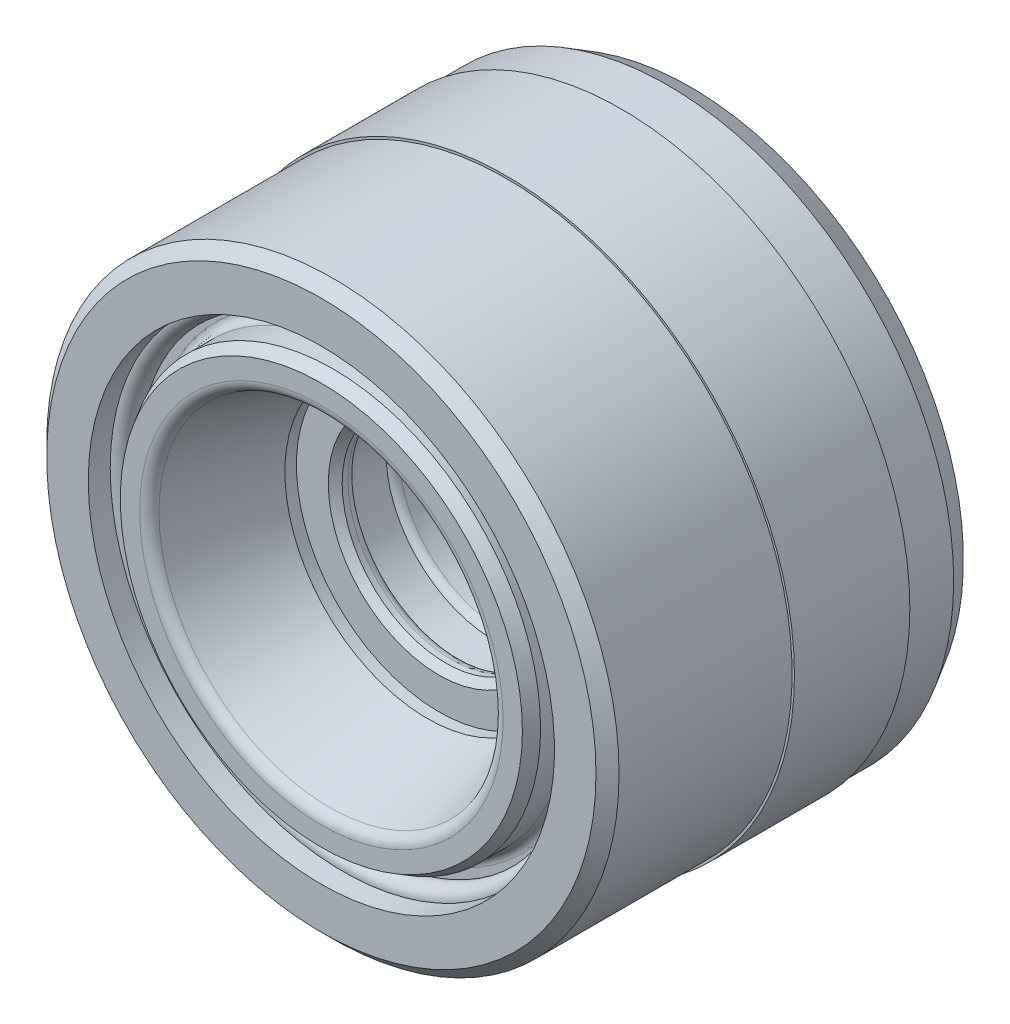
ISO-10303-21;
HEADER;
FILE_DESCRIPTION(('STEP AP214'),'2;1');
FILE_NAME('part.step','',(''),(''),'','','');
FILE_SCHEMA(('AUTOMOTIVE_DESIGN { 1 0 10303 214 1 1 1 1 }'));
ENDSEC;
DATA;
#1=APPLICATION_CONTEXT('core data for automotive mechanical design processes');
#2=APPLICATION_PROTOCOL_DEFINITION('international standard','automotive_design',2000,#1);
#3=PRODUCT_CONTEXT('',#1,'mechanical');
#4=PRODUCT('Part','Part','',(#3));
#5=PRODUCT_RELATED_PRODUCT_CATEGORY('part','',(#4));
#6=PRODUCT_DEFINITION_FORMATION('','',#4);
#7=PRODUCT_DEFINITION_CONTEXT('part definition',#1,'design');
#8=PRODUCT_DEFINITION('design','',#6,#7);
#9=PRODUCT_DEFINITION_SHAPE('','',#8);
#10=(LENGTH_UNIT() NAMED_UNIT(*) SI_UNIT(.MILLI.,.METRE.));
#11=(NAMED_UNIT(*) PLANE_ANGLE_UNIT() SI_UNIT($,.RADIAN.));
#12=(NAMED_UNIT(*) SI_UNIT($,.STERADIAN.) SOLID_ANGLE_UNIT());
#13=UNCERTAINTY_MEASURE_WITH_UNIT(LENGTH_MEASURE(1.E-05),#10,'distance_accuracy_value','');
#14=(GEOMETRIC_REPRESENTATION_CONTEXT(3) GLOBAL_UNCERTAINTY_ASSIGNED_CONTEXT((#13)) GLOBAL_UNIT_ASSIGNED_CONTEXT((#10,
#11,#12)) REPRESENTATION_CONTEXT('',''));
#15=CARTESIAN_POINT('',(0.,0.,0.));
#16=DIRECTION('',(0.,0.,1.));
#17=DIRECTION('',(1.,0.,0.));
#18=AXIS2_PLACEMENT_3D('',#15,#16,#17);
#19=CARTESIAN_POINT('',(6.18097122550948,0.,-5.1));
#20=DIRECTION('',(0.,0.,1.));
#21=DIRECTION('',(1.,0.,0.));
#22=AXIS2_PLACEMENT_3D('',#19,#20,#21);
#23=PLANE('',#22);
#24=CARTESIAN_POINT('',(0.,0.,-5.1));
#25=DIRECTION('',(0.,0.,1.));
#26=DIRECTION('',(1.,0.,0.));
#27=AXIS2_PLACEMENT_3D('',#24,#25,#26);
#28=CIRCLE('',#27,4.8);
#29=CARTESIAN_POINT('',(4.8,0.,-5.1));
#30=VERTEX_POINT('',#29);
#31=EDGE_CURVE('E67',#30,#30,#28,.F.);
#32=ORIENTED_EDGE('',*,*,#31,.T.);
#33=EDGE_LOOP('',(#32));
#34=FACE_BOUND('',#33,.T.);
#35=CARTESIAN_POINT('',(0.,0.,-5.1));
#36=DIRECTION('',(0.,0.,1.));
#37=DIRECTION('',(1.,0.,0.));
#38=AXIS2_PLACEMENT_3D('',#35,#36,#37);
#39=CIRCLE('',#38,6.18097122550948);
#40=CARTESIAN_POINT('',(6.18097122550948,0.,-5.1));
#41=VERTEX_POINT('',#40);
#42=EDGE_CURVE('E58',#41,#41,#39,.T.);
#43=ORIENTED_EDGE('',*,*,#42,.T.);
#44=EDGE_LOOP('',(#43));
#45=FACE_BOUND('',#44,.T.);
#46=ADVANCED_FACE('F12',(#34,#45),#23,.T.);
#47=CARTESIAN_POINT('',(0.,0.,-5.4));
#48=DIRECTION('',(0.,0.,1.));
#49=DIRECTION('',(1.,0.,0.));
#50=AXIS2_PLACEMENT_3D('',#47,#48,#49);
#51=CONICAL_SURFACE('',#50,4.5,0.785398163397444);
#52=ORIENTED_EDGE('',*,*,#31,.F.);
#53=EDGE_LOOP('',(#52));
#54=FACE_BOUND('',#53,.T.);
#55=CARTESIAN_POINT('',(0.,0.,-5.4));
#56=DIRECTION('',(0.,0.,1.));
#57=DIRECTION('',(1.,0.,0.));
#58=AXIS2_PLACEMENT_3D('',#55,#56,#57);
#59=CIRCLE('',#58,4.5);
#60=CARTESIAN_POINT('',(4.5,0.,-5.4));
#61=VERTEX_POINT('',#60);
#62=EDGE_CURVE('E64',#61,#61,#59,.T.);
#63=ORIENTED_EDGE('',*,*,#62,.F.);
#64=EDGE_LOOP('',(#63));
#65=FACE_BOUND('',#64,.T.);
#66=ADVANCED_FACE('F166',(#54,#65),#51,.F.);
#67=CARTESIAN_POINT('',(0.,0.,-5.1));
#68=DIRECTION('',(0.,0.,1.));
#69=DIRECTION('',(1.,0.,0.));
#70=AXIS2_PLACEMENT_3D('',#67,#68,#69);
#71=CYLINDRICAL_SURFACE('',#70,4.5);
#72=CARTESIAN_POINT('',(0.,0.,-5.65358983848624));
#73=DIRECTION('',(0.,0.,-1.));
#74=DIRECTION('',(-1.,0.,0.));
#75=AXIS2_PLACEMENT_3D('',#72,#73,#74);
#76=CIRCLE('',#75,4.5);
#77=CARTESIAN_POINT('',(-4.5,0.,-5.65358983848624));
#78=VERTEX_POINT('',#77);
#79=EDGE_CURVE('E73',#78,#78,#76,.T.);
#80=ORIENTED_EDGE('',*,*,#79,.T.);
#81=EDGE_LOOP('',(#80));
#82=FACE_BOUND('',#81,.T.);
#83=ORIENTED_EDGE('',*,*,#62,.T.);
#84=EDGE_LOOP('',(#83));
#85=FACE_BOUND('',#84,.T.);
#86=ADVANCED_FACE('F173',(#82,#85),#71,.F.);
#87=CARTESIAN_POINT('',(0.,0.,-5.65358983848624));
#88=DIRECTION('',(0.,0.,-1.));
#89=DIRECTION('',(-1.,0.,0.));
#90=AXIS2_PLACEMENT_3D('',#87,#88,#89);
#91=TOROIDAL_SURFACE('',#90,4.9,0.4);
#92=ORIENTED_EDGE('',*,*,#79,.F.);
#93=EDGE_LOOP('',(#92));
#94=FACE_BOUND('',#93,.T.);
#95=CARTESIAN_POINT('',(0.,0.,-6.));
#96=DIRECTION('',(0.,0.,1.));
#97=DIRECTION('',(1.,0.,0.));
#98=AXIS2_PLACEMENT_3D('',#95,#96,#97);
#99=CIRCLE('',#98,4.7);
#100=CARTESIAN_POINT('',(4.7,0.,-6.));
#101=VERTEX_POINT('',#100);
#102=EDGE_CURVE('E44',#101,#101,#99,.T.);
#103=ORIENTED_EDGE('',*,*,#102,.F.);
#104=EDGE_LOOP('',(#103));
#105=FACE_BOUND('',#104,.T.);
#106=ADVANCED_FACE('F201',(#94,#105),#91,.T.);
#107=CARTESIAN_POINT('',(0.,0.,0.));
#108=DIRECTION('',(0.,0.,1.));
#109=DIRECTION('',(1.,0.,0.));
#110=AXIS2_PLACEMENT_3D('',#107,#108,#109);
#111=CYLINDRICAL_SURFACE('',#110,4.7);
#112=CARTESIAN_POINT('',(0.,0.,-7.5));
#113=DIRECTION('',(0.,0.,1.));
#114=DIRECTION('',(1.,0.,0.));
#115=AXIS2_PLACEMENT_3D('',#112,#113,#114);
#116=CIRCLE('',#115,4.7);
#117=CARTESIAN_POINT('',(4.7,0.,-7.5));
#118=VERTEX_POINT('',#117);
#119=EDGE_CURVE('E48',#118,#118,#116,.T.);
#120=ORIENTED_EDGE('',*,*,#119,.F.);
#121=EDGE_LOOP('',(#120));
#122=FACE_BOUND('',#121,.T.);
#123=ORIENTED_EDGE('',*,*,#102,.T.);
#124=EDGE_LOOP('',(#123));
#125=FACE_BOUND('',#124,.T.);
#126=ADVANCED_FACE('F199',(#122,#125),#111,.F.);
#127=CARTESIAN_POINT('',(0.,0.,-7.84641016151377));
#128=DIRECTION('',(0.,0.,1.));
#129=DIRECTION('',(1.,0.,0.));
#130=AXIS2_PLACEMENT_3D('',#127,#128,#129);
#131=TOROIDAL_SURFACE('',#130,4.9,0.4);
#132=ORIENTED_EDGE('',*,*,#119,.T.);
#133=EDGE_LOOP('',(#132));
#134=FACE_BOUND('',#133,.T.);
#135=CARTESIAN_POINT('',(0.,0.,-7.84641016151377));
#136=DIRECTION('',(0.,0.,1.));
#137=DIRECTION('',(1.,0.,0.));
#138=AXIS2_PLACEMENT_3D('',#135,#136,#137);
#139=CIRCLE('',#138,4.5);
#140=CARTESIAN_POINT('',(4.5,0.,-7.84641016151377));
#141=VERTEX_POINT('',#140);
#142=EDGE_CURVE('E70',#141,#141,#139,.T.);
#143=ORIENTED_EDGE('',*,*,#142,.F.);
#144=EDGE_LOOP('',(#143));
#145=FACE_BOUND('',#144,.T.);
#146=ADVANCED_FACE('F195',(#134,#145),#131,.T.);
#147=ORIENTED_EDGE('',*,*,#142,.T.);
#148=EDGE_LOOP('',(#147));
#149=FACE_BOUND('',#148,.T.);
#150=CARTESIAN_POINT('',(0.,0.,-10.5));
#151=DIRECTION('',(0.,0.,1.));
#152=DIRECTION('',(1.,0.,0.));
#153=AXIS2_PLACEMENT_3D('',#150,#151,#152);
#154=CIRCLE('',#153,4.5);
#155=CARTESIAN_POINT('',(4.5,0.,-10.5));
#156=VERTEX_POINT('',#155);
#157=EDGE_CURVE('E53',#156,#156,#154,.T.);
#158=ORIENTED_EDGE('',*,*,#157,.F.);
#159=EDGE_LOOP('',(#158));
#160=FACE_BOUND('',#159,.T.);
#161=ADVANCED_FACE('F198',(#149,#160),#71,.F.);
#162=CARTESIAN_POINT('',(5.05,0.,-10.5));
#163=DIRECTION('',(0.,0.,-1.));
#164=DIRECTION('',(-1.,0.,0.));
#165=AXIS2_PLACEMENT_3D('',#162,#163,#164);
#166=PLANE('',#165);
#167=ORIENTED_EDGE('',*,*,#157,.T.);
#168=EDGE_LOOP('',(#167));
#169=FACE_BOUND('',#168,.T.);
#170=CARTESIAN_POINT('',(0.,0.,-10.5));
#171=DIRECTION('',(0.,0.,1.));
#172=DIRECTION('',(1.,0.,0.));
#173=AXIS2_PLACEMENT_3D('',#170,#171,#172);
#174=CIRCLE('',#173,6.);
#175=CARTESIAN_POINT('',(6.,0.,-10.5));
#176=VERTEX_POINT('',#175);
#177=EDGE_CURVE('E8',#176,#176,#174,.F.);
#178=ORIENTED_EDGE('',*,*,#177,.T.);
#179=EDGE_LOOP('',(#178));
#180=FACE_BOUND('',#179,.T.);
#181=ADVANCED_FACE('F179',(#169,#180),#166,.T.);
#182=CARTESIAN_POINT('',(0.,0.,0.));
#183=DIRECTION('',(0.,0.,1.));
#184=DIRECTION('',(1.,0.,0.));
#185=AXIS2_PLACEMENT_3D('',#182,#183,#184);
#186=CYLINDRICAL_SURFACE('',#185,6.18097122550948);
#187=CARTESIAN_POINT('',(0.,0.,-4.6));
#188=DIRECTION('',(0.,0.,1.));
#189=DIRECTION('',(1.,0.,0.));
#190=AXIS2_PLACEMENT_3D('',#187,#188,#189);
#191=CIRCLE('',#190,6.18097122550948);
#192=CARTESIAN_POINT('',(6.18097122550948,0.,-4.6));
#193=VERTEX_POINT('',#192);
#194=EDGE_CURVE('E61',#193,#193,#191,.T.);
#195=ORIENTED_EDGE('',*,*,#194,.T.);
#196=EDGE_LOOP('',(#195));
#197=FACE_BOUND('',#196,.T.);
#198=ORIENTED_EDGE('',*,*,#42,.F.);
#199=EDGE_LOOP('',(#198));
#200=FACE_BOUND('',#199,.T.);
#201=ADVANCED_FACE('F181',(#197,#200),#186,.F.);
#202=CARTESIAN_POINT('',(0.,0.,-4.6));
#203=DIRECTION('',(0.,0.,1.));
#204=DIRECTION('',(1.,0.,0.));
#205=AXIS2_PLACEMENT_3D('',#202,#203,#204);
#206=CONICAL_SURFACE('',#205,6.18097122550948,0.279252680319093);
#207=CARTESIAN_POINT('',(0.,0.,-0.362181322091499));
#208=DIRECTION('',(0.,0.,-1.));
#209=DIRECTION('',(-1.,0.,0.));
#210=AXIS2_PLACEMENT_3D('',#207,#208,#209);
#211=CIRCLE('',#210,7.39614617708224);
#212=CARTESIAN_POINT('',(-7.39614617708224,0.,-0.362181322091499));
#213=VERTEX_POINT('',#212);
#214=EDGE_CURVE('E76',#213,#213,#211,.F.);
#215=ORIENTED_EDGE('',*,*,#214,.T.);
#216=EDGE_LOOP('',(#215));
#217=FACE_BOUND('',#216,.T.);
#218=ORIENTED_EDGE('',*,*,#194,.F.);
#219=EDGE_LOOP('',(#218));
#220=FACE_BOUND('',#219,.T.);
#221=ADVANCED_FACE('F184',(#217,#220),#206,.F.);
#222=CARTESIAN_POINT('',(0.,0.,-0.5));
#223=DIRECTION('',(0.,0.,1.));
#224=DIRECTION('',(1.,0.,0.));
#225=AXIS2_PLACEMENT_3D('',#222,#223,#224);
#226=TOROIDAL_SURFACE('',#225,7.8767770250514,0.5);
#227=CARTESIAN_POINT('',(0.,0.,0.));
#228=DIRECTION('',(0.,0.,1.));
#229=DIRECTION('',(1.,0.,0.));
#230=AXIS2_PLACEMENT_3D('',#227,#228,#229);
#231=CIRCLE('',#230,7.8767770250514);
#232=CARTESIAN_POINT('',(7.8767770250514,0.,0.));
#233=VERTEX_POINT('',#232);
#234=EDGE_CURVE('E79',#233,#233,#231,.F.);
#235=ORIENTED_EDGE('',*,*,#234,.F.);
#236=EDGE_LOOP('',(#235));
#237=FACE_BOUND('',#236,.T.);
#238=ORIENTED_EDGE('',*,*,#214,.F.);
#239=EDGE_LOOP('',(#238));
#240=FACE_BOUND('',#239,.T.);
#241=ADVANCED_FACE('F188',(#237,#240),#226,.T.);
#242=CARTESIAN_POINT('',(10.1,0.,0.));
#243=DIRECTION('',(0.,0.,1.));
#244=DIRECTION('',(1.,0.,0.));
#245=AXIS2_PLACEMENT_3D('',#242,#243,#244);
#246=PLANE('',#245);
#247=CARTESIAN_POINT('',(0.,0.,0.));
#248=DIRECTION('',(0.,0.,1.));
#249=DIRECTION('',(1.,0.,0.));
#250=AXIS2_PLACEMENT_3D('',#247,#248,#249);
#251=CIRCLE('',#250,8.71132486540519);
#252=CARTESIAN_POINT('',(8.71132486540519,0.,0.));
#253=VERTEX_POINT('',#252);
#254=EDGE_CURVE('E88',#253,#253,#251,.T.);
#255=ORIENTED_EDGE('',*,*,#254,.T.);
#256=EDGE_LOOP('',(#255));
#257=FACE_BOUND('',#256,.T.);
#258=ORIENTED_EDGE('',*,*,#234,.T.);
#259=EDGE_LOOP('',(#258));
#260=FACE_BOUND('',#259,.T.);
#261=ADVANCED_FACE('F190',(#257,#260),#246,.T.);
#262=CARTESIAN_POINT('',(0.,0.,0.));
#263=DIRECTION('',(0.,0.,-1.));
#264=DIRECTION('',(-1.,0.,0.));
#265=AXIS2_PLACEMENT_3D('',#262,#263,#264);
#266=CONICAL_SURFACE('',#265,8.71132486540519,0.523598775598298);
#267=CARTESIAN_POINT('',(0.,0.,-0.5));
#268=DIRECTION('',(0.,0.,1.));
#269=DIRECTION('',(1.,0.,0.));
#270=AXIS2_PLACEMENT_3D('',#267,#268,#269);
#271=CIRCLE('',#270,9.);
#272=CARTESIAN_POINT('',(9.,0.,-0.5));
#273=VERTEX_POINT('',#272);
#274=EDGE_CURVE('E25',#273,#273,#271,.F.);
#275=ORIENTED_EDGE('',*,*,#274,.F.);
#276=EDGE_LOOP('',(#275));
#277=FACE_BOUND('',#276,.T.);
#278=ORIENTED_EDGE('',*,*,#254,.F.);
#279=EDGE_LOOP('',(#278));
#280=FACE_BOUND('',#279,.T.);
#281=ADVANCED_FACE('F192',(#277,#280),#266,.T.);
#282=CARTESIAN_POINT('',(0.,0.,0.));
#283=DIRECTION('',(0.,0.,1.));
#284=DIRECTION('',(1.,0.,0.));
#285=AXIS2_PLACEMENT_3D('',#282,#283,#284);
#286=CYLINDRICAL_SURFACE('',#285,9.);
#287=ORIENTED_EDGE('',*,*,#274,.T.);
#288=EDGE_LOOP('',(#287));
#289=FACE_BOUND('',#288,.T.);
#290=CARTESIAN_POINT('',(0.,0.,-1.65));
#291=DIRECTION('',(0.,0.,1.));
#292=DIRECTION('',(1.,0.,0.));
#293=AXIS2_PLACEMENT_3D('',#290,#291,#292);
#294=CIRCLE('',#293,9.);
#295=CARTESIAN_POINT('',(9.,0.,-1.65));
#296=VERTEX_POINT('',#295);
#297=EDGE_CURVE('E82',#296,#296,#294,.T.);
#298=ORIENTED_EDGE('',*,*,#297,.T.);
#299=EDGE_LOOP('',(#298));
#300=FACE_BOUND('',#299,.T.);
#301=ADVANCED_FACE('F211',(#289,#300),#286,.T.);
#302=CARTESIAN_POINT('',(0.,0.,-1.65));
#303=DIRECTION('',(0.,0.,1.));
#304=DIRECTION('',(1.,0.,0.));
#305=AXIS2_PLACEMENT_3D('',#302,#303,#304);
#306=TOROIDAL_SURFACE('',#305,9.4,0.4);
#307=CARTESIAN_POINT('',(0.,0.,-2.05));
#308=DIRECTION('',(0.,0.,1.));
#309=DIRECTION('',(1.,0.,0.));
#310=AXIS2_PLACEMENT_3D('',#307,#308,#309);
#311=CIRCLE('',#310,9.4);
#312=CARTESIAN_POINT('',(9.4,0.,-2.05));
#313=VERTEX_POINT('',#312);
#314=EDGE_CURVE('E85',#313,#313,#311,.F.);
#315=ORIENTED_EDGE('',*,*,#314,.F.);
#316=EDGE_LOOP('',(#315));
#317=FACE_BOUND('',#316,.T.);
#318=ORIENTED_EDGE('',*,*,#297,.F.);
#319=EDGE_LOOP('',(#318));
#320=FACE_BOUND('',#319,.T.);
#321=ADVANCED_FACE('F208',(#317,#320),#306,.F.);
#322=CARTESIAN_POINT('',(-10.1,0.,-2.05));
#323=DIRECTION('',(0.,0.,1.));
#324=DIRECTION('',(1.,0.,0.));
#325=AXIS2_PLACEMENT_3D('',#322,#323,#324);
#326=PLANE('',#325);
#327=ORIENTED_EDGE('',*,*,#314,.T.);
#328=EDGE_LOOP('',(#327));
#329=FACE_BOUND('',#328,.T.);
#330=CARTESIAN_POINT('',(0.,0.,-2.05));
#331=DIRECTION('',(0.,0.,1.));
#332=DIRECTION('',(1.,0.,0.));
#333=AXIS2_PLACEMENT_3D('',#330,#331,#332);
#334=CIRCLE('',#333,10.3985610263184);
#335=CARTESIAN_POINT('',(10.3985610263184,0.,-2.05));
#336=VERTEX_POINT('',#335);
#337=EDGE_CURVE('E20',#336,#336,#334,.T.);
#338=ORIENTED_EDGE('',*,*,#337,.T.);
#339=EDGE_LOOP('',(#338));
#340=FACE_BOUND('',#339,.T.);
#341=ADVANCED_FACE('F158',(#329,#340),#326,.T.);
#342=CARTESIAN_POINT('',(-12.4,0.,-13.));
#343=DIRECTION('',(0.,0.,-1.));
#344=DIRECTION('',(-1.,0.,0.));
#345=AXIS2_PLACEMENT_3D('',#342,#343,#344);
#346=PLANE('',#345);
#347=CARTESIAN_POINT('',(0.,0.,-13.));
#348=DIRECTION('',(0.,0.,1.));
#349=DIRECTION('',(1.,0.,0.));
#350=AXIS2_PLACEMENT_3D('',#347,#348,#349);
#351=CIRCLE('',#350,12.4);
#352=CARTESIAN_POINT('',(12.4,0.,-13.));
#353=VERTEX_POINT('',#352);
#354=EDGE_CURVE('E102',#353,#353,#351,.T.);
#355=ORIENTED_EDGE('',*,*,#354,.T.);
#356=EDGE_LOOP('',(#355));
#357=FACE_BOUND('',#356,.T.);
#358=CARTESIAN_POINT('',(0.,0.,-13.));
#359=DIRECTION('',(0.,0.,1.));
#360=DIRECTION('',(1.,0.,0.));
#361=AXIS2_PLACEMENT_3D('',#358,#359,#360);
#362=CIRCLE('',#361,12.5);
#363=CARTESIAN_POINT('',(12.5,0.,-13.));
#364=VERTEX_POINT('',#363);
#365=EDGE_CURVE('E99',#364,#364,#362,.T.);
#366=ORIENTED_EDGE('',*,*,#365,.F.);
#367=EDGE_LOOP('',(#366));
#368=FACE_BOUND('',#367,.T.);
#369=ADVANCED_FACE('F220',(#357,#368),#346,.T.);
#370=CARTESIAN_POINT('',(0.,0.,0.));
#371=DIRECTION('',(0.,0.,-1.));
#372=DIRECTION('',(-1.,0.,0.));
#373=AXIS2_PLACEMENT_3D('',#370,#371,#372);
#374=CYLINDRICAL_SURFACE('',#373,12.5);
#375=CARTESIAN_POINT('',(0.,0.,-8.));
#376=DIRECTION('',(0.,0.,-1.));
#377=DIRECTION('',(-1.,0.,0.));
#378=AXIS2_PLACEMENT_3D('',#375,#376,#377);
#379=CIRCLE('',#378,12.5);
#380=CARTESIAN_POINT('',(-12.5,0.,-8.));
#381=VERTEX_POINT('',#380);
#382=EDGE_CURVE('E108',#381,#381,#379,.T.);
#383=ORIENTED_EDGE('',*,*,#382,.T.);
#384=EDGE_LOOP('',(#383));
#385=FACE_BOUND('',#384,.T.);
#386=ORIENTED_EDGE('',*,*,#365,.T.);
#387=EDGE_LOOP('',(#386));
#388=FACE_BOUND('',#387,.T.);
#389=ADVANCED_FACE('F223',(#385,#388),#374,.T.);
#390=CARTESIAN_POINT('',(-12.5,0.,-8.));
#391=DIRECTION('',(0.,0.,-1.));
#392=DIRECTION('',(-1.,0.,0.));
#393=AXIS2_PLACEMENT_3D('',#390,#391,#392);
#394=PLANE('',#393);
#395=ORIENTED_EDGE('',*,*,#382,.F.);
#396=EDGE_LOOP('',(#395));
#397=FACE_BOUND('',#396,.T.);
#398=CARTESIAN_POINT('',(0.,0.,-8.));
#399=DIRECTION('',(0.,0.,-1.));
#400=DIRECTION('',(-1.,0.,0.));
#401=AXIS2_PLACEMENT_3D('',#398,#399,#400);
#402=CIRCLE('',#401,12.4);
#403=CARTESIAN_POINT('',(-12.4,0.,-8.));
#404=VERTEX_POINT('',#403);
#405=EDGE_CURVE('E105',#404,#404,#402,.T.);
#406=ORIENTED_EDGE('',*,*,#405,.T.);
#407=EDGE_LOOP('',(#406));
#408=FACE_BOUND('',#407,.T.);
#409=ADVANCED_FACE('F234',(#397,#408),#394,.F.);
#410=CARTESIAN_POINT('',(0.,0.,0.));
#411=DIRECTION('',(0.,0.,-1.));
#412=DIRECTION('',(-1.,0.,0.));
#413=AXIS2_PLACEMENT_3D('',#410,#411,#412);
#414=CYLINDRICAL_SURFACE('',#413,12.4);
#415=CARTESIAN_POINT('',(0.,0.,-0.5));
#416=DIRECTION('',(0.,0.,1.));
#417=DIRECTION('',(1.,0.,0.));
#418=AXIS2_PLACEMENT_3D('',#415,#416,#417);
#419=CIRCLE('',#418,12.4);
#420=CARTESIAN_POINT('',(12.4,0.,-0.5));
#421=VERTEX_POINT('',#420);
#422=EDGE_CURVE('E126',#421,#421,#419,.F.);
#423=ORIENTED_EDGE('',*,*,#422,.T.);
#424=EDGE_LOOP('',(#423));
#425=FACE_BOUND('',#424,.T.);
#426=ORIENTED_EDGE('',*,*,#405,.F.);
#427=EDGE_LOOP('',(#426));
#428=FACE_BOUND('',#427,.T.);
#429=ADVANCED_FACE('F230',(#425,#428),#414,.T.);
#430=CARTESIAN_POINT('',(0.,0.,-0.5));
#431=DIRECTION('',(0.,0.,-1.));
#432=DIRECTION('',(-1.,0.,0.));
#433=AXIS2_PLACEMENT_3D('',#430,#431,#432);
#434=CONICAL_SURFACE('',#433,12.4,0.785398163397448);
#435=CARTESIAN_POINT('',(0.,0.,0.));
#436=DIRECTION('',(0.,0.,1.));
#437=DIRECTION('',(1.,0.,0.));
#438=AXIS2_PLACEMENT_3D('',#435,#436,#437);
#439=CIRCLE('',#438,11.9);
#440=CARTESIAN_POINT('',(11.9,0.,0.));
#441=VERTEX_POINT('',#440);
#442=EDGE_CURVE('E129',#441,#441,#439,.T.);
#443=ORIENTED_EDGE('',*,*,#442,.F.);
#444=EDGE_LOOP('',(#443));
#445=FACE_BOUND('',#444,.T.);
#446=ORIENTED_EDGE('',*,*,#422,.F.);
#447=EDGE_LOOP('',(#446));
#448=FACE_BOUND('',#447,.T.);
#449=ADVANCED_FACE('F233',(#445,#448),#434,.T.);
#450=CARTESIAN_POINT('',(-12.5,0.,0.));
#451=DIRECTION('',(0.,0.,1.));
#452=DIRECTION('',(1.,0.,0.));
#453=AXIS2_PLACEMENT_3D('',#450,#451,#452);
#454=PLANE('',#453);
#455=ORIENTED_EDGE('',*,*,#442,.T.);
#456=EDGE_LOOP('',(#455));
#457=FACE_BOUND('',#456,.T.);
#458=CARTESIAN_POINT('',(0.,0.,0.));
#459=DIRECTION('',(0.,0.,-1.));
#460=DIRECTION('',(-1.,0.,0.));
#461=AXIS2_PLACEMENT_3D('',#458,#459,#460);
#462=CIRCLE('',#461,10.1);
#463=CARTESIAN_POINT('',(-10.1,0.,0.));
#464=VERTEX_POINT('',#463);
#465=EDGE_CURVE('E111',#464,#464,#462,.T.);
#466=ORIENTED_EDGE('',*,*,#465,.T.);
#467=EDGE_LOOP('',(#466));
#468=FACE_BOUND('',#467,.T.);
#469=ADVANCED_FACE('F246',(#457,#468),#454,.T.);
#470=CARTESIAN_POINT('',(0.,0.,0.));
#471=DIRECTION('',(0.,0.,-1.));
#472=DIRECTION('',(-1.,0.,0.));
#473=AXIS2_PLACEMENT_3D('',#470,#471,#472);
#474=CYLINDRICAL_SURFACE('',#473,10.1);
#475=ORIENTED_EDGE('',*,*,#465,.F.);
#476=EDGE_LOOP('',(#475));
#477=FACE_BOUND('',#476,.T.);
#478=CARTESIAN_POINT('',(0.,0.,-0.95));
#479=DIRECTION('',(0.,0.,1.));
#480=DIRECTION('',(1.,0.,0.));
#481=AXIS2_PLACEMENT_3D('',#478,#479,#480);
#482=CIRCLE('',#481,10.1);
#483=CARTESIAN_POINT('',(10.1,0.,-0.95));
#484=VERTEX_POINT('',#483);
#485=EDGE_CURVE('E96',#484,#484,#482,.T.);
#486=ORIENTED_EDGE('',*,*,#485,.F.);
#487=EDGE_LOOP('',(#486));
#488=FACE_BOUND('',#487,.T.);
#489=ADVANCED_FACE('F218',(#477,#488),#474,.F.);
#490=CARTESIAN_POINT('',(-10.1,0.,-0.95));
#491=DIRECTION('',(0.,0.,-1.));
#492=DIRECTION('',(-1.,0.,0.));
#493=AXIS2_PLACEMENT_3D('',#490,#491,#492);
#494=PLANE('',#493);
#495=ORIENTED_EDGE('',*,*,#485,.T.);
#496=EDGE_LOOP('',(#495));
#497=FACE_BOUND('',#496,.T.);
#498=CARTESIAN_POINT('',(0.,0.,-0.95));
#499=DIRECTION('',(0.,0.,1.));
#500=DIRECTION('',(1.,0.,0.));
#501=AXIS2_PLACEMENT_3D('',#498,#499,#500);
#502=CIRCLE('',#501,10.3985610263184);
#503=CARTESIAN_POINT('',(10.3985610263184,0.,-0.95));
#504=VERTEX_POINT('',#503);
#505=EDGE_CURVE('E93',#504,#504,#502,.T.);
#506=ORIENTED_EDGE('',*,*,#505,.F.);
#507=EDGE_LOOP('',(#506));
#508=FACE_BOUND('',#507,.T.);
#509=ADVANCED_FACE('F162',(#497,#508),#494,.T.);
#510=CARTESIAN_POINT('',(0.,0.,4.7614292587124));
#511=DIRECTION('',(0.,0.,1.));
#512=DIRECTION('',(1.,0.,0.));
#513=AXIS2_PLACEMENT_3D('',#510,#511,#512);
#514=CYLINDRICAL_SURFACE('',#513,10.3985610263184);
#515=CARTESIAN_POINT('',(0.,0.,-1.0989248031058));
#516=DIRECTION('',(0.,0.,-1.));
#517=DIRECTION('',(-1.,0.,0.));
#518=AXIS2_PLACEMENT_3D('',#515,#516,#517);
#519=CIRCLE('',#518,10.3985610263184);
#520=CARTESIAN_POINT('',(-10.3985610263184,0.,-1.0989248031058));
#521=VERTEX_POINT('',#520);
#522=EDGE_CURVE('E39',#521,#521,#519,.T.);
#523=ORIENTED_EDGE('',*,*,#522,.T.);
#524=EDGE_LOOP('',(#523));
#525=FACE_BOUND('',#524,.T.);
#526=ORIENTED_EDGE('',*,*,#505,.T.);
#527=EDGE_LOOP('',(#526));
#528=FACE_BOUND('',#527,.T.);
#529=ADVANCED_FACE('F146',(#525,#528),#514,.F.);
#530=CARTESIAN_POINT('',(0.,0.,-1.5));
#531=DIRECTION('',(0.,0.,-1.));
#532=DIRECTION('',(0.,1.,0.));
#533=AXIS2_PLACEMENT_3D('',#530,#531,#532);
#534=TOROIDAL_SURFACE('',#533,10.1,0.5);
#535=ORIENTED_EDGE('',*,*,#522,.F.);
#536=EDGE_LOOP('',(#535));
#537=FACE_BOUND('',#536,.T.);
#538=CARTESIAN_POINT('',(0.,0.,-1.9010751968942));
#539=DIRECTION('',(0.,0.,1.));
#540=DIRECTION('',(1.,0.,0.));
#541=AXIS2_PLACEMENT_3D('',#538,#539,#540);
#542=CIRCLE('',#541,10.3985610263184);
#543=CARTESIAN_POINT('',(10.3985610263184,0.,-1.9010751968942));
#544=VERTEX_POINT('',#543);
#545=EDGE_CURVE('E16',#544,#544,#542,.T.);
#546=ORIENTED_EDGE('',*,*,#545,.F.);
#547=EDGE_LOOP('',(#546));
#548=FACE_BOUND('',#547,.T.);
#549=ADVANCED_FACE('F14',(#537,#548),#534,.T.);
#550=ORIENTED_EDGE('',*,*,#337,.F.);
#551=EDGE_LOOP('',(#550));
#552=FACE_BOUND('',#551,.T.);
#553=ORIENTED_EDGE('',*,*,#545,.T.);
#554=EDGE_LOOP('',(#553));
#555=FACE_BOUND('',#554,.T.);
#556=ADVANCED_FACE('F164',(#552,#555),#514,.F.);
#557=CARTESIAN_POINT('',(0.,0.,0.));
#558=DIRECTION('',(0.,0.,1.));
#559=DIRECTION('',(1.,0.,0.));
#560=AXIS2_PLACEMENT_3D('',#557,#558,#559);
#561=CYLINDRICAL_SURFACE('',#560,12.4);
#562=CARTESIAN_POINT('',(0.,0.,-15.));
#563=DIRECTION('',(0.,0.,-1.));
#564=DIRECTION('',(-1.,0.,0.));
#565=AXIS2_PLACEMENT_3D('',#562,#563,#564);
#566=CIRCLE('',#565,12.4);
#567=CARTESIAN_POINT('',(-12.4,0.,-15.));
#568=VERTEX_POINT('',#567);
#569=EDGE_CURVE('E114',#568,#568,#566,.F.);
#570=ORIENTED_EDGE('',*,*,#569,.T.);
#571=EDGE_LOOP('',(#570));
#572=FACE_BOUND('',#571,.T.);
#573=ORIENTED_EDGE('',*,*,#354,.F.);
#574=EDGE_LOOP('',(#573));
#575=FACE_BOUND('',#574,.T.);
#576=ADVANCED_FACE('F225',(#572,#575),#561,.T.);
#577=CARTESIAN_POINT('',(0.,0.,-15.));
#578=DIRECTION('',(0.,0.,1.));
#579=DIRECTION('',(1.,0.,0.));
#580=AXIS2_PLACEMENT_3D('',#577,#578,#579);
#581=CONICAL_SURFACE('',#580,12.4,0.523598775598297);
#582=CARTESIAN_POINT('',(0.,0.,-16.));
#583=DIRECTION('',(0.,0.,-1.));
#584=DIRECTION('',(-1.,0.,0.));
#585=AXIS2_PLACEMENT_3D('',#582,#583,#584);
#586=CIRCLE('',#585,11.8226497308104);
#587=CARTESIAN_POINT('',(-11.8226497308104,0.,-16.));
#588=VERTEX_POINT('',#587);
#589=EDGE_CURVE('E117',#588,#588,#586,.T.);
#590=ORIENTED_EDGE('',*,*,#589,.F.);
#591=EDGE_LOOP('',(#590));
#592=FACE_BOUND('',#591,.T.);
#593=ORIENTED_EDGE('',*,*,#569,.F.);
#594=EDGE_LOOP('',(#593));
#595=FACE_BOUND('',#594,.T.);
#596=ADVANCED_FACE('F228',(#592,#595),#581,.T.);
#597=CARTESIAN_POINT('',(-12.5,0.,-16.));
#598=DIRECTION('',(0.,0.,-1.));
#599=DIRECTION('',(-1.,0.,0.));
#600=AXIS2_PLACEMENT_3D('',#597,#598,#599);
#601=PLANE('',#600);
#602=CARTESIAN_POINT('',(0.,0.,-16.));
#603=DIRECTION('',(0.,0.,-1.));
#604=DIRECTION('',(-1.,0.,0.));
#605=AXIS2_PLACEMENT_3D('',#602,#603,#604);
#606=CIRCLE('',#605,3.9);
#607=CARTESIAN_POINT('',(-3.9,0.,-16.));
#608=VERTEX_POINT('',#607);
#609=EDGE_CURVE('E34',#608,#608,#606,.F.);
#610=ORIENTED_EDGE('',*,*,#609,.T.);
#611=EDGE_LOOP('',(#610));
#612=FACE_BOUND('',#611,.T.);
#613=ORIENTED_EDGE('',*,*,#589,.T.);
#614=EDGE_LOOP('',(#613));
#615=FACE_BOUND('',#614,.T.);
#616=ADVANCED_FACE('F254',(#612,#615),#601,.T.);
#617=CARTESIAN_POINT('',(0.,0.,-16.));
#618=DIRECTION('',(0.,0.,-1.));
#619=DIRECTION('',(-1.,0.,0.));
#620=AXIS2_PLACEMENT_3D('',#617,#618,#619);
#621=CONICAL_SURFACE('',#620,3.9,0.785398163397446);
#622=CARTESIAN_POINT('',(0.,0.,-15.5));
#623=DIRECTION('',(0.,0.,-1.));
#624=DIRECTION('',(-1.,0.,0.));
#625=AXIS2_PLACEMENT_3D('',#622,#623,#624);
#626=CIRCLE('',#625,3.4);
#627=CARTESIAN_POINT('',(-3.4,0.,-15.5));
#628=VERTEX_POINT('',#627);
#629=EDGE_CURVE('E37',#628,#628,#626,.T.);
#630=ORIENTED_EDGE('',*,*,#629,.F.);
#631=EDGE_LOOP('',(#630));
#632=FACE_BOUND('',#631,.T.);
#633=ORIENTED_EDGE('',*,*,#609,.F.);
#634=EDGE_LOOP('',(#633));
#635=FACE_BOUND('',#634,.T.);
#636=ADVANCED_FACE('F155',(#632,#635),#621,.F.);
#637=CARTESIAN_POINT('',(0.,0.,-11.7));
#638=DIRECTION('',(0.,0.,1.));
#639=DIRECTION('',(1.,0.,0.));
#640=AXIS2_PLACEMENT_3D('',#637,#638,#639);
#641=CYLINDRICAL_SURFACE('',#640,3.4);
#642=ORIENTED_EDGE('',*,*,#629,.T.);
#643=EDGE_LOOP('',(#642));
#644=FACE_BOUND('',#643,.T.);
#645=CARTESIAN_POINT('',(0.,0.,-12.7));
#646=DIRECTION('',(0.,0.,-1.));
#647=DIRECTION('',(-1.,0.,0.));
#648=AXIS2_PLACEMENT_3D('',#645,#646,#647);
#649=CIRCLE('',#648,3.4);
#650=CARTESIAN_POINT('',(-3.4,0.,-12.7));
#651=VERTEX_POINT('',#650);
#652=EDGE_CURVE('E131',#651,#651,#649,.F.);
#653=ORIENTED_EDGE('',*,*,#652,.T.);
#654=EDGE_LOOP('',(#653));
#655=FACE_BOUND('',#654,.T.);
#656=ADVANCED_FACE('F144',(#644,#655),#641,.F.);
#657=CARTESIAN_POINT('',(0.,0.,-12.7));
#658=DIRECTION('',(0.,0.,1.));
#659=DIRECTION('',(1.,0.,0.));
#660=AXIS2_PLACEMENT_3D('',#657,#658,#659);
#661=CONICAL_SURFACE('',#660,3.4,0.78539816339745);
#662=CARTESIAN_POINT('',(0.,0.,-11.7));
#663=DIRECTION('',(0.,0.,-1.));
#664=DIRECTION('',(-1.,0.,0.));
#665=AXIS2_PLACEMENT_3D('',#662,#663,#664);
#666=CIRCLE('',#665,4.4);
#667=CARTESIAN_POINT('',(-4.4,0.,-11.7));
#668=VERTEX_POINT('',#667);
#669=EDGE_CURVE('E29',#668,#668,#666,.T.);
#670=ORIENTED_EDGE('',*,*,#669,.F.);
#671=EDGE_LOOP('',(#670));
#672=FACE_BOUND('',#671,.T.);
#673=ORIENTED_EDGE('',*,*,#652,.F.);
#674=EDGE_LOOP('',(#673));
#675=FACE_BOUND('',#674,.T.);
#676=ADVANCED_FACE('F141',(#672,#675),#661,.F.);
#677=CARTESIAN_POINT('',(0.,0.,-11.7));
#678=DIRECTION('',(0.,0.,-1.));
#679=DIRECTION('',(-1.,0.,0.));
#680=AXIS2_PLACEMENT_3D('',#677,#678,#679);
#681=PLANE('',#680);
#682=ORIENTED_EDGE('',*,*,#669,.T.);
#683=EDGE_LOOP('',(#682));
#684=FACE_BOUND('',#683,.T.);
#685=CARTESIAN_POINT('',(0.,0.,-11.7));
#686=DIRECTION('',(0.,0.,-1.));
#687=DIRECTION('',(-1.,0.,0.));
#688=AXIS2_PLACEMENT_3D('',#685,#686,#687);
#689=CIRCLE('',#688,5.1);
#690=CARTESIAN_POINT('',(-5.1,0.,-11.7));
#691=VERTEX_POINT('',#690);
#692=EDGE_CURVE('E123',#691,#691,#689,.F.);
#693=ORIENTED_EDGE('',*,*,#692,.T.);
#694=EDGE_LOOP('',(#693));
#695=FACE_BOUND('',#694,.T.);
#696=ADVANCED_FACE('F138',(#684,#695),#681,.F.);
#697=CARTESIAN_POINT('',(0.,0.,-11.3));
#698=DIRECTION('',(0.,0.,-1.));
#699=DIRECTION('',(-1.,0.,0.));
#700=AXIS2_PLACEMENT_3D('',#697,#698,#699);
#701=TOROIDAL_SURFACE('',#700,5.1,0.4);
#702=ORIENTED_EDGE('',*,*,#692,.F.);
#703=EDGE_LOOP('',(#702));
#704=FACE_BOUND('',#703,.T.);
#705=CARTESIAN_POINT('',(0.,0.,-11.3));
#706=DIRECTION('',(0.,0.,-1.));
#707=DIRECTION('',(-1.,0.,0.));
#708=AXIS2_PLACEMENT_3D('',#705,#706,#707);
#709=CIRCLE('',#708,5.5);
#710=CARTESIAN_POINT('',(-5.5,0.,-11.3));
#711=VERTEX_POINT('',#710);
#712=EDGE_CURVE('E120',#711,#711,#709,.T.);
#713=ORIENTED_EDGE('',*,*,#712,.F.);
#714=EDGE_LOOP('',(#713));
#715=FACE_BOUND('',#714,.T.);
#716=ADVANCED_FACE('F153',(#704,#715),#701,.F.);
#717=CARTESIAN_POINT('',(0.,0.,-11.7));
#718=DIRECTION('',(0.,0.,1.));
#719=DIRECTION('',(1.,0.,0.));
#720=AXIS2_PLACEMENT_3D('',#717,#718,#719);
#721=CYLINDRICAL_SURFACE('',#720,5.5);
#722=CARTESIAN_POINT('',(0.,0.,-11.));
#723=DIRECTION('',(0.,0.,1.));
#724=DIRECTION('',(1.,0.,0.));
#725=AXIS2_PLACEMENT_3D('',#722,#723,#724);
#726=CIRCLE('',#725,5.5);
#727=CARTESIAN_POINT('',(5.5,0.,-11.));
#728=VERTEX_POINT('',#727);
#729=EDGE_CURVE('E31',#728,#728,#726,.T.);
#730=ORIENTED_EDGE('',*,*,#729,.T.);
#731=EDGE_LOOP('',(#730));
#732=FACE_BOUND('',#731,.T.);
#733=ORIENTED_EDGE('',*,*,#712,.T.);
#734=EDGE_LOOP('',(#733));
#735=FACE_BOUND('',#734,.T.);
#736=ADVANCED_FACE('F239',(#732,#735),#721,.F.);
#737=CARTESIAN_POINT('',(0.,0.,-10.5));
#738=DIRECTION('',(0.,0.,1.));
#739=DIRECTION('',(1.,0.,0.));
#740=AXIS2_PLACEMENT_3D('',#737,#738,#739);
#741=CONICAL_SURFACE('',#740,6.,0.785398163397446);
#742=ORIENTED_EDGE('',*,*,#729,.F.);
#743=EDGE_LOOP('',(#742));
#744=FACE_BOUND('',#743,.T.);
#745=ORIENTED_EDGE('',*,*,#177,.F.);
#746=EDGE_LOOP('',(#745));
#747=FACE_BOUND('',#746,.T.);
#748=ADVANCED_FACE('F242',(#744,#747),#741,.F.);
#749=CLOSED_SHELL('',(#46,#66,#86,#106,#126,#146,#161,#181,#201,#221,#241,#261,#281,#301,#321,
#341,#369,#389,#409,#429,#449,#469,#489,#509,#529,#549,#556,#576,#596,#616,#636,#656,#676,#696,
#716,#736,#748));
#750=MANIFOLD_SOLID_BREP('B1',#749);
#751=ADVANCED_BREP_SHAPE_REPRESENTATION('',(#18,#750),#14);
#752=SHAPE_DEFINITION_REPRESENTATION(#9,#751);
ENDSEC;
END-ISO-10303-21;
